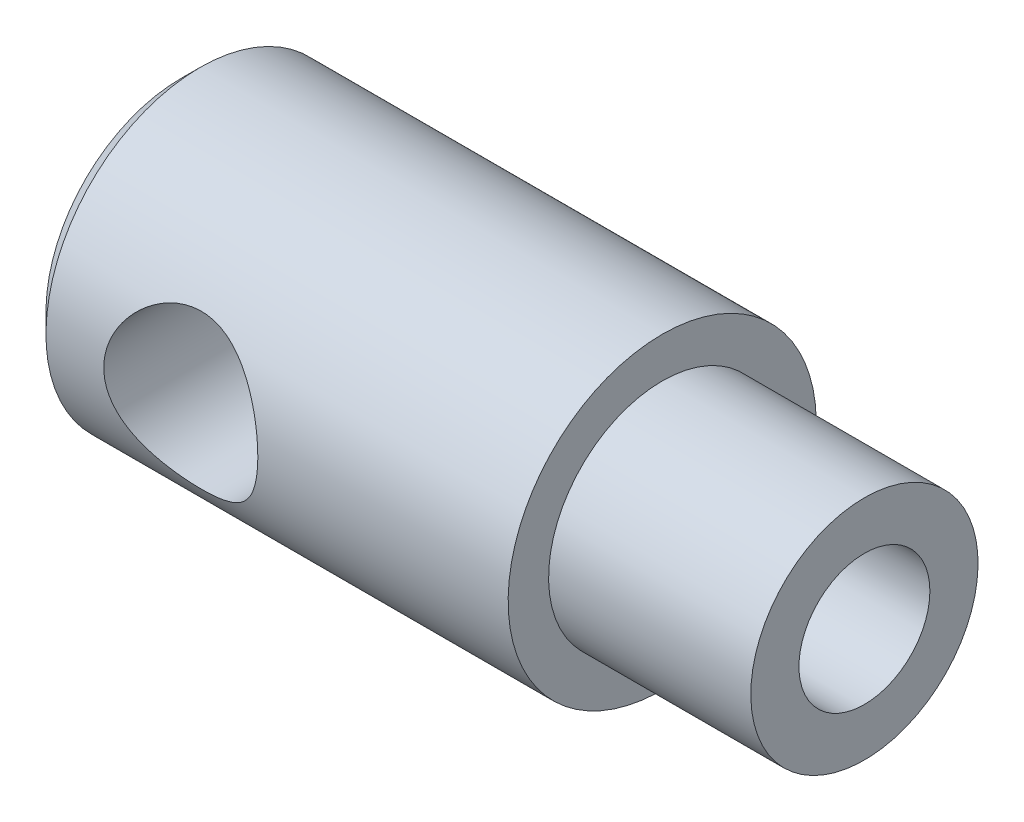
ISO-10303-21;
HEADER;
FILE_DESCRIPTION(('STEP AP214'),'2;1');
FILE_NAME('part.step','',(''),(''),'','','');
FILE_SCHEMA(('AUTOMOTIVE_DESIGN { 1 0 10303 214 1 1 1 1 }'));
ENDSEC;
DATA;
#1=APPLICATION_CONTEXT('core data for automotive mechanical design processes');
#2=APPLICATION_PROTOCOL_DEFINITION('international standard','automotive_design',2000,#1);
#3=PRODUCT_CONTEXT('',#1,'mechanical');
#4=PRODUCT('Part','Part','',(#3));
#5=PRODUCT_RELATED_PRODUCT_CATEGORY('part','',(#4));
#6=PRODUCT_DEFINITION_FORMATION('','',#4);
#7=PRODUCT_DEFINITION_CONTEXT('part definition',#1,'design');
#8=PRODUCT_DEFINITION('design','',#6,#7);
#9=PRODUCT_DEFINITION_SHAPE('','',#8);
#10=(LENGTH_UNIT() NAMED_UNIT(*) SI_UNIT(.MILLI.,.METRE.));
#11=(NAMED_UNIT(*) PLANE_ANGLE_UNIT() SI_UNIT($,.RADIAN.));
#12=(NAMED_UNIT(*) SI_UNIT($,.STERADIAN.) SOLID_ANGLE_UNIT());
#13=UNCERTAINTY_MEASURE_WITH_UNIT(LENGTH_MEASURE(1.E-05),#10,'distance_accuracy_value','');
#14=(GEOMETRIC_REPRESENTATION_CONTEXT(3) GLOBAL_UNCERTAINTY_ASSIGNED_CONTEXT((#13)) GLOBAL_UNIT_ASSIGNED_CONTEXT((#10,
#11,#12)) REPRESENTATION_CONTEXT('',''));
#15=CARTESIAN_POINT('',(0.,0.,0.));
#16=DIRECTION('',(0.,0.,1.));
#17=DIRECTION('',(1.,0.,0.));
#18=AXIS2_PLACEMENT_3D('',#15,#16,#17);
#19=CARTESIAN_POINT('',(0.,0.,0.));
#20=DIRECTION('',(-1.,0.,0.));
#21=DIRECTION('',(0.,-1.,0.));
#22=AXIS2_PLACEMENT_3D('',#19,#20,#21);
#23=PLANE('',#22);
#24=CARTESIAN_POINT('',(0.,0.,0.));
#25=DIRECTION('',(1.,0.,0.));
#26=DIRECTION('',(0.,1.,0.));
#27=AXIS2_PLACEMENT_3D('',#24,#25,#26);
#28=CIRCLE('',#27,6.99999999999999);
#29=CARTESIAN_POINT('',(0.,6.99999999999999,0.));
#30=VERTEX_POINT('',#29);
#31=EDGE_CURVE('E10',#30,#30,#28,.T.);
#32=ORIENTED_EDGE('',*,*,#31,.F.);
#33=EDGE_LOOP('',(#32));
#34=FACE_BOUND('',#33,.T.);
#35=ADVANCED_FACE('F34',(#34),#23,.T.);
#36=CARTESIAN_POINT('',(1.,0.,0.));
#37=DIRECTION('',(1.,0.,0.));
#38=DIRECTION('',(0.,1.,0.));
#39=AXIS2_PLACEMENT_3D('',#36,#37,#38);
#40=CONICAL_SURFACE('',#39,7.99999999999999,0.785398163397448);
#41=ORIENTED_EDGE('',*,*,#31,.T.);
#42=EDGE_LOOP('',(#41));
#43=FACE_BOUND('',#42,.T.);
#44=CARTESIAN_POINT('',(1.,0.,0.));
#45=DIRECTION('',(1.,0.,0.));
#46=DIRECTION('',(0.,1.,0.));
#47=AXIS2_PLACEMENT_3D('',#44,#45,#46);
#48=CIRCLE('',#47,7.99999999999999);
#49=CARTESIAN_POINT('',(1.,7.99999999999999,0.));
#50=VERTEX_POINT('',#49);
#51=EDGE_CURVE('E45',#50,#50,#48,.T.);
#52=ORIENTED_EDGE('',*,*,#51,.F.);
#53=EDGE_LOOP('',(#52));
#54=FACE_BOUND('',#53,.T.);
#55=ADVANCED_FACE('F87',(#43,#54),#40,.T.);
#56=CARTESIAN_POINT('',(35.5,0.,0.));
#57=DIRECTION('',(1.,0.,0.));
#58=DIRECTION('',(0.,1.,0.));
#59=AXIS2_PLACEMENT_3D('',#56,#57,#58);
#60=CYLINDRICAL_SURFACE('',#59,7.99999999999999);
#61=CARTESIAN_POINT('',(12.,0.,-7.99999999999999));
#62=CARTESIAN_POINT('',(11.9999995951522,-0.105191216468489,-7.99999964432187));
#63=CARTESIAN_POINT('',(11.9958455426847,-0.210389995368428,-7.99792027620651));
#64=CARTESIAN_POINT('',(11.9792779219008,-0.420011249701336,-7.98965597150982));
#65=CARTESIAN_POINT('',(11.9668607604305,-0.524433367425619,-7.98346924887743));
#66=CARTESIAN_POINT('',(11.9338864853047,-0.731828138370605,-7.96713597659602));
#67=CARTESIAN_POINT('',(11.9133177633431,-0.834798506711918,-7.95698378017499));
#68=CARTESIAN_POINT('',(11.8642827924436,-1.0384152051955,-7.93298382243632));
#69=CARTESIAN_POINT('',(11.8358133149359,-1.1390605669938,-7.91913455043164));
#70=CARTESIAN_POINT('',(11.7392517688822,-1.43561775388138,-7.87265974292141));
#71=CARTESIAN_POINT('',(11.6598370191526,-1.6271962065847,-7.83501976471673));
#72=CARTESIAN_POINT('',(11.4737109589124,-1.99392146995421,-7.74982886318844));
#73=CARTESIAN_POINT('',(11.3670018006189,-2.16906957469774,-7.70227872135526));
#74=CARTESIAN_POINT('',(11.1219301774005,-2.51002321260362,-7.59825056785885));
#75=CARTESIAN_POINT('',(10.9820433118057,-2.67462250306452,-7.54140647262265));
#76=CARTESIAN_POINT('',(10.6779248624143,-2.97911611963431,-7.42640030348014));
#77=CARTESIAN_POINT('',(10.5136749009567,-3.11899161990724,-7.36823726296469));
#78=CARTESIAN_POINT('',(10.1500210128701,-3.38102385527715,-7.25195135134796));
#79=CARTESIAN_POINT('',(9.94887869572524,-3.50096528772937,-7.19418138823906));
#80=CARTESIAN_POINT('',(9.63206546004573,-3.65378721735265,-7.11709930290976));
#81=CARTESIAN_POINT('',(9.5239053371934,-3.70022392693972,-7.09299422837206));
#82=CARTESIAN_POINT('',(9.30319902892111,-3.78359067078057,-7.04887690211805));
#83=CARTESIAN_POINT('',(9.1906554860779,-3.82052633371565,-7.02886222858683));
#84=CARTESIAN_POINT('',(8.96880578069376,-3.88251046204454,-6.99480449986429));
#85=CARTESIAN_POINT('',(8.85970358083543,-3.9081340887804,-6.98047764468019));
#86=CARTESIAN_POINT('',(8.63925947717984,-3.95018060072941,-6.95677065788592));
#87=CARTESIAN_POINT('',(8.52791879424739,-3.96660836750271,-6.94738790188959));
#88=CARTESIAN_POINT('',(8.30399390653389,-3.99001913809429,-6.93396933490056));
#89=CARTESIAN_POINT('',(8.19141049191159,-3.99700782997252,-6.92993030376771));
#90=CARTESIAN_POINT('',(7.96599952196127,-4.00144340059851,-6.92737022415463));
#91=CARTESIAN_POINT('',(7.853171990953,-3.99889118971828,-6.92884864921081));
#92=CARTESIAN_POINT('',(7.64183562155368,-3.98516575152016,-6.93675038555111));
#93=CARTESIAN_POINT('',(7.54323256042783,-3.97506329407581,-6.94255931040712));
#94=CARTESIAN_POINT('',(7.34734838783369,-3.94763759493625,-6.9581892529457));
#95=CARTESIAN_POINT('',(7.25006770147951,-3.93031208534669,-6.96801153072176));
#96=CARTESIAN_POINT('',(6.96122086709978,-3.86777248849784,-7.00304835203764));
#97=CARTESIAN_POINT('',(6.77250454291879,-3.81198555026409,-7.03383903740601));
#98=CARTESIAN_POINT('',(6.40305366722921,-3.6728359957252,-7.10749917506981));
#99=CARTESIAN_POINT('',(6.22260742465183,-3.58886132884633,-7.15063327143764));
#100=CARTESIAN_POINT('',(5.87746981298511,-3.39616568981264,-7.24413652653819));
#101=CARTESIAN_POINT('',(5.71278556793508,-3.28743360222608,-7.29450893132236));
#102=CARTESIAN_POINT('',(5.38191711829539,-3.03227252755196,-7.40452458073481));
#103=CARTESIAN_POINT('',(5.2181904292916,-2.88281182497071,-7.46453347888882));
#104=CARTESIAN_POINT('',(4.91704039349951,-2.55818830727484,-7.58191186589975));
#105=CARTESIAN_POINT('',(4.77962961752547,-2.38301327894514,-7.63928008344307));
#106=CARTESIAN_POINT('',(4.59324696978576,-2.09944472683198,-7.72027607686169));
#107=CARTESIAN_POINT('',(4.53331824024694,-1.9989679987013,-7.74696304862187));
#108=CARTESIAN_POINT('',(4.42223352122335,-1.79256850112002,-7.79730441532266));
#109=CARTESIAN_POINT('',(4.37107383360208,-1.68664805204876,-7.82096008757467));
#110=CARTESIAN_POINT('',(4.2780808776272,-1.47010242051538,-7.86454042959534));
#111=CARTESIAN_POINT('',(4.23624385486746,-1.35947915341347,-7.88446660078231));
#112=CARTESIAN_POINT('',(4.1623800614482,-1.13432950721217,-7.91999221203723));
#113=CARTESIAN_POINT('',(4.13035216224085,-1.01980357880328,-7.93559214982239));
#114=CARTESIAN_POINT('',(4.07877315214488,-0.797438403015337,-7.96087677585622));
#115=CARTESIAN_POINT('',(4.05840840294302,-0.689830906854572,-7.97094436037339));
#116=CARTESIAN_POINT('',(4.0265535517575,-0.472998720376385,-7.98674429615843));
#117=CARTESIAN_POINT('',(4.01506266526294,-0.363774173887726,-7.99247703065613));
#118=CARTESIAN_POINT('',(4.00110952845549,-0.144648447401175,-7.99944300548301));
#119=CARTESIAN_POINT('',(3.99864382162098,-0.0347475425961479,-8.00067796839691));
#120=CARTESIAN_POINT('',(4.00276424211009,0.184837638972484,-7.99861804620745));
#121=CARTESIAN_POINT('',(4.00934996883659,0.294521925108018,-7.99532336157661));
#122=CARTESIAN_POINT('',(4.03062356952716,0.504259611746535,-7.98472734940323));
#123=CARTESIAN_POINT('',(4.04464106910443,0.60439825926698,-7.97775776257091));
#124=CARTESIAN_POINT('',(4.08013639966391,0.803035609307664,-7.96021983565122));
#125=CARTESIAN_POINT('',(4.10161676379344,0.901533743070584,-7.94965027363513));
#126=CARTESIAN_POINT('',(4.17693517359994,1.19351737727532,-7.91289127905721));
#127=CARTESIAN_POINT('',(4.24167014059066,1.38368108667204,-7.88164133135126));
#128=CARTESIAN_POINT('',(4.39999810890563,1.75558493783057,-7.80736894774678));
#129=CARTESIAN_POINT('',(4.49436330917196,1.93692876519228,-7.76403545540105));
#130=CARTESIAN_POINT('',(4.70843103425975,2.28183826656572,-7.6697587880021));
#131=CARTESIAN_POINT('',(4.82814435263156,2.44539632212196,-7.61881237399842));
#132=CARTESIAN_POINT('',(5.10303311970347,2.76706877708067,-7.50833088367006));
#133=CARTESIAN_POINT('',(5.26053653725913,2.92307134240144,-7.44844369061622));
#134=CARTESIAN_POINT('',(5.5997355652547,3.20744226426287,-7.33048735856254));
#135=CARTESIAN_POINT('',(5.7814477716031,3.33579150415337,-7.27241950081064));
#136=CARTESIAN_POINT('',(6.07399401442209,3.50772930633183,-7.1902816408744));
#137=CARTESIAN_POINT('',(6.17748375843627,3.5626157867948,-7.16316684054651));
#138=CARTESIAN_POINT('',(6.3895184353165,3.66334616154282,-7.11217812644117));
#139=CARTESIAN_POINT('',(6.49806090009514,3.70919441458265,-7.08830265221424));
#140=CARTESIAN_POINT('',(6.71942164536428,3.79131200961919,-7.04472262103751));
#141=CARTESIAN_POINT('',(6.83223640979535,3.82758904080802,-7.02501471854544));
#142=CARTESIAN_POINT('',(7.06135278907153,3.89012004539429,-6.99058253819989));
#143=CARTESIAN_POINT('',(7.17765386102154,3.91637557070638,-6.9758574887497));
#144=CARTESIAN_POINT('',(7.40141213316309,3.95643062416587,-6.9532102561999));
#145=CARTESIAN_POINT('',(7.50864683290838,3.97118378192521,-6.94477079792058));
#146=CARTESIAN_POINT('',(7.72422767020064,3.99195118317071,-6.93285441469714));
#147=CARTESIAN_POINT('',(7.8325736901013,3.99796634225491,-6.92937696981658));
#148=CARTESIAN_POINT('',(8.04940749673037,4.00116308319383,-6.92753208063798));
#149=CARTESIAN_POINT('',(8.15789522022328,3.99834777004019,-6.92916284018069));
#150=CARTESIAN_POINT('',(8.37406114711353,3.98394653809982,-6.93745093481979));
#151=CARTESIAN_POINT('',(8.48173938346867,3.97236097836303,-6.94410806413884));
#152=CARTESIAN_POINT('',(8.78180013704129,3.92770249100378,-6.9695287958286));
#153=CARTESIAN_POINT('',(8.97236586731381,3.88483285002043,-6.99372760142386));
#154=CARTESIAN_POINT('',(9.34326850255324,3.77270184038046,-7.05483682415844));
#155=CARTESIAN_POINT('',(9.5236020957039,3.70343198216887,-7.09175132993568));
#156=CARTESIAN_POINT('',(9.88248855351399,3.53526338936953,-7.17714225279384));
#157=CARTESIAN_POINT('',(10.0601077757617,3.43468670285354,-7.22622883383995));
#158=CARTESIAN_POINT('',(10.397101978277,3.20860173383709,-7.32941332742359));
#159=CARTESIAN_POINT('',(10.5564673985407,3.08308048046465,-7.38351383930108));
#160=CARTESIAN_POINT('',(10.8725629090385,2.7928225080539,-7.49849148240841));
#161=CARTESIAN_POINT('',(11.0266199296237,2.625174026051,-7.55939328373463));
#162=CARTESIAN_POINT('',(11.3050684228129,2.26458287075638,-7.67511613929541));
#163=CARTESIAN_POINT('',(11.4294439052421,2.0716266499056,-7.72993390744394));
#164=CARTESIAN_POINT('',(11.5909042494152,1.76603106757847,-7.80335210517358));
#165=CARTESIAN_POINT('',(11.640693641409,1.66100410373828,-7.82643367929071));
#166=CARTESIAN_POINT('',(11.7311489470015,1.44639623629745,-7.86891796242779));
#167=CARTESIAN_POINT('',(11.771819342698,1.33681760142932,-7.8883224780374));
#168=CARTESIAN_POINT('',(11.843476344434,1.11415600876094,-7.92283587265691));
#169=CARTESIAN_POINT('',(11.8744840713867,1.00108129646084,-7.93795411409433));
#170=CARTESIAN_POINT('',(11.9265100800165,0.772189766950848,-7.96347694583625));
#171=CARTESIAN_POINT('',(11.9475344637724,0.656374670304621,-7.97388441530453));
#172=CARTESIAN_POINT('',(11.9755796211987,0.45043331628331,-7.98781110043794));
#173=CARTESIAN_POINT('',(11.984729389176,0.360660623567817,-7.99237392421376));
#174=CARTESIAN_POINT('',(11.9969398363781,0.18059382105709,-7.99846856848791));
#175=CARTESIAN_POINT('',(12.000000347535,0.0902996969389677,-8.00000030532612));
#176=CARTESIAN_POINT('',(12.,0.,-7.99999999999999));
#177=B_SPLINE_CURVE_WITH_KNOTS('',3,(#61,#62,#63,#64,#65,#66,#67,#68,#69,#70,#71,#72,#73,#74,
#75,#76,#77,#78,#79,#80,#81,#82,#83,#84,#85,#86,#87,#88,#89,#90,#91,#92,#93,#94,#95,#96,#97,#98,
#99,#100,#101,#102,#103,#104,#105,#106,#107,#108,#109,#110,#111,#112,#113,#114,#115,#116,#117,
#118,#119,#120,#121,#122,#123,#124,#125,#126,#127,#128,#129,#130,#131,#132,#133,#134,#135,#136,
#137,#138,#139,#140,#141,#142,#143,#144,#145,#146,#147,#148,#149,#150,#151,#152,#153,#154,#155,
#156,#157,#158,#159,#160,#161,#162,#163,#164,#165,#166,#167,#168,#169,#170,#171,#172,#173,#174,
#175,#176),.UNSPECIFIED.,.T.,.F.,(4,2,2,2,2,2,2,2,2,2,2,2,2,2,2,2,2,2,2,2,2,2,2,2,2,2,2,2,2,2,2,
2,2,2,2,2,2,2,2,2,2,2,2,2,2,2,2,2,2,2,2,2,2,2,2,2,2,4),(0.,0.315484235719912,0.631105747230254,
0.947178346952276,1.26338029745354,1.89263632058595,2.52184274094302,3.18911473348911,
3.85689264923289,4.57645675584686,4.93648208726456,5.29629363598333,5.63476191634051,
5.97305035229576,6.31113484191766,6.64918707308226,6.94669148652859,7.24428938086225,
7.83905304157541,8.44767049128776,9.05656173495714,9.74265853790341,10.4290822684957,
10.7886699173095,11.1481055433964,11.5073961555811,11.8666454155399,12.1961419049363,
12.5256092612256,12.8549504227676,13.184277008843,13.4879760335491,13.791778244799,
14.3988188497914,15.0232162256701,15.6478800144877,16.33388641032,17.0203655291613,
17.380682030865,17.7408243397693,18.1006764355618,18.4604727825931,18.7857371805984,
19.1109674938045,19.4360834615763,19.7611861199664,20.3488209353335,20.9366448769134,
21.5639619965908,22.1916061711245,22.8955134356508,23.5997990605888,23.9548906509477,
24.3098073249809,24.6639426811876,25.0178613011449,25.2886761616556,25.5594984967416),.UNSPECIFIED.);
#178=CARTESIAN_POINT('',(12.,0.,-7.99999999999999));
#179=VERTEX_POINT('',#178);
#180=EDGE_CURVE('E59',#179,#179,#177,.T.);
#181=ORIENTED_EDGE('',*,*,#180,.F.);
#182=EDGE_LOOP('',(#181));
#183=FACE_BOUND('',#182,.T.);
#184=CARTESIAN_POINT('',(12.,0.,7.99999999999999));
#185=CARTESIAN_POINT('',(11.9999995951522,0.105191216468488,7.99999964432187));
#186=CARTESIAN_POINT('',(11.9958455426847,0.210389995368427,7.99792027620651));
#187=CARTESIAN_POINT('',(11.9792779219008,0.420011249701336,7.98965597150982));
#188=CARTESIAN_POINT('',(11.9668607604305,0.524433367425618,7.98346924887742));
#189=CARTESIAN_POINT('',(11.9338864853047,0.731828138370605,7.96713597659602));
#190=CARTESIAN_POINT('',(11.9133177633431,0.834798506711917,7.95698378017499));
#191=CARTESIAN_POINT('',(11.8642827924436,1.0384152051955,7.93298382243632));
#192=CARTESIAN_POINT('',(11.8358133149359,1.1390605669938,7.91913455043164));
#193=CARTESIAN_POINT('',(11.7392517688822,1.43561775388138,7.87265974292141));
#194=CARTESIAN_POINT('',(11.6598370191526,1.6271962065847,7.83501976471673));
#195=CARTESIAN_POINT('',(11.4737109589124,1.99392146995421,7.74982886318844));
#196=CARTESIAN_POINT('',(11.3670018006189,2.16906957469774,7.70227872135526));
#197=CARTESIAN_POINT('',(11.1219301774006,2.51002321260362,7.59825056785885));
#198=CARTESIAN_POINT('',(10.9820433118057,2.67462250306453,7.54140647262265));
#199=CARTESIAN_POINT('',(10.6779248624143,2.97911611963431,7.42640030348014));
#200=CARTESIAN_POINT('',(10.5136749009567,3.11899161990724,7.36823726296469));
#201=CARTESIAN_POINT('',(10.1500210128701,3.38102385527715,7.25195135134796));
#202=CARTESIAN_POINT('',(9.94887869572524,3.50096528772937,7.19418138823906));
#203=CARTESIAN_POINT('',(9.63206546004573,3.65378721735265,7.11709930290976));
#204=CARTESIAN_POINT('',(9.5239053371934,3.70022392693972,7.09299422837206));
#205=CARTESIAN_POINT('',(9.30319902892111,3.78359067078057,7.04887690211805));
#206=CARTESIAN_POINT('',(9.1906554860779,3.82052633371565,7.02886222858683));
#207=CARTESIAN_POINT('',(8.96880578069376,3.88251046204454,6.99480449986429));
#208=CARTESIAN_POINT('',(8.85970358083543,3.9081340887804,6.98047764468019));
#209=CARTESIAN_POINT('',(8.63925947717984,3.95018060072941,6.95677065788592));
#210=CARTESIAN_POINT('',(8.52791879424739,3.96660836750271,6.94738790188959));
#211=CARTESIAN_POINT('',(8.30399390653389,3.99001913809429,6.93396933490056));
#212=CARTESIAN_POINT('',(8.19141049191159,3.99700782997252,6.92993030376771));
#213=CARTESIAN_POINT('',(7.96599952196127,4.00144340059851,6.92737022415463));
#214=CARTESIAN_POINT('',(7.853171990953,3.99889118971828,6.92884864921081));
#215=CARTESIAN_POINT('',(7.64183562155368,3.98516575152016,6.93675038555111));
#216=CARTESIAN_POINT('',(7.54323256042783,3.97506329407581,6.94255931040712));
#217=CARTESIAN_POINT('',(7.34734838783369,3.94763759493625,6.95818925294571));
#218=CARTESIAN_POINT('',(7.25006770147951,3.93031208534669,6.96801153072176));
#219=CARTESIAN_POINT('',(6.96122086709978,3.86777248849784,7.00304835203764));
#220=CARTESIAN_POINT('',(6.77250454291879,3.81198555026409,7.03383903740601));
#221=CARTESIAN_POINT('',(6.40305366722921,3.6728359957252,7.10749917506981));
#222=CARTESIAN_POINT('',(6.22260742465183,3.58886132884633,7.15063327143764));
#223=CARTESIAN_POINT('',(5.87746981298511,3.39616568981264,7.24413652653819));
#224=CARTESIAN_POINT('',(5.71278556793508,3.28743360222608,7.29450893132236));
#225=CARTESIAN_POINT('',(5.38191711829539,3.03227252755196,7.40452458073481));
#226=CARTESIAN_POINT('',(5.2181904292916,2.88281182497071,7.46453347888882));
#227=CARTESIAN_POINT('',(4.91704039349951,2.55818830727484,7.58191186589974));
#228=CARTESIAN_POINT('',(4.77962961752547,2.38301327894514,7.63928008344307));
#229=CARTESIAN_POINT('',(4.59324696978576,2.09944472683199,7.72027607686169));
#230=CARTESIAN_POINT('',(4.53331824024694,1.9989679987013,7.74696304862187));
#231=CARTESIAN_POINT('',(4.42223352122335,1.79256850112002,7.79730441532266));
#232=CARTESIAN_POINT('',(4.37107383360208,1.68664805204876,7.82096008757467));
#233=CARTESIAN_POINT('',(4.2780808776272,1.47010242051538,7.86454042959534));
#234=CARTESIAN_POINT('',(4.23624385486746,1.35947915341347,7.88446660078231));
#235=CARTESIAN_POINT('',(4.1623800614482,1.13432950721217,7.91999221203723));
#236=CARTESIAN_POINT('',(4.13035216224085,1.01980357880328,7.93559214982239));
#237=CARTESIAN_POINT('',(4.07877315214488,0.797438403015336,7.96087677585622));
#238=CARTESIAN_POINT('',(4.05840840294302,0.68983090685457,7.97094436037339));
#239=CARTESIAN_POINT('',(4.0265535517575,0.472998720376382,7.98674429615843));
#240=CARTESIAN_POINT('',(4.01506266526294,0.363774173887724,7.99247703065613));
#241=CARTESIAN_POINT('',(4.00110952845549,0.144648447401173,7.99944300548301));
#242=CARTESIAN_POINT('',(3.99864382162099,0.0347475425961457,8.00067796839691));
#243=CARTESIAN_POINT('',(4.00276424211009,-0.184837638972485,7.99861804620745));
#244=CARTESIAN_POINT('',(4.00934996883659,-0.294521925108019,7.99532336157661));
#245=CARTESIAN_POINT('',(4.03062356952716,-0.504259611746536,7.98472734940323));
#246=CARTESIAN_POINT('',(4.04464106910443,-0.604398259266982,7.97775776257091));
#247=CARTESIAN_POINT('',(4.08013639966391,-0.803035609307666,7.96021983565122));
#248=CARTESIAN_POINT('',(4.10161676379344,-0.901533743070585,7.94965027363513));
#249=CARTESIAN_POINT('',(4.17693517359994,-1.19351737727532,7.91289127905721));
#250=CARTESIAN_POINT('',(4.24167014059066,-1.38368108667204,7.88164133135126));
#251=CARTESIAN_POINT('',(4.39999810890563,-1.75558493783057,7.80736894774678));
#252=CARTESIAN_POINT('',(4.49436330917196,-1.93692876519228,7.76403545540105));
#253=CARTESIAN_POINT('',(4.70843103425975,-2.28183826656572,7.6697587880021));
#254=CARTESIAN_POINT('',(4.82814435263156,-2.44539632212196,7.61881237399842));
#255=CARTESIAN_POINT('',(5.10303311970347,-2.76706877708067,7.50833088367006));
#256=CARTESIAN_POINT('',(5.26053653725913,-2.92307134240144,7.44844369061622));
#257=CARTESIAN_POINT('',(5.5997355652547,-3.20744226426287,7.33048735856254));
#258=CARTESIAN_POINT('',(5.7814477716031,-3.33579150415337,7.27241950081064));
#259=CARTESIAN_POINT('',(6.07399401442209,-3.50772930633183,7.1902816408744));
#260=CARTESIAN_POINT('',(6.17748375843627,-3.5626157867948,7.16316684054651));
#261=CARTESIAN_POINT('',(6.3895184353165,-3.66334616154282,7.11217812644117));
#262=CARTESIAN_POINT('',(6.49806090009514,-3.70919441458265,7.08830265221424));
#263=CARTESIAN_POINT('',(6.71942164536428,-3.79131200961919,7.04472262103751));
#264=CARTESIAN_POINT('',(6.83223640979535,-3.82758904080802,7.02501471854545));
#265=CARTESIAN_POINT('',(7.06135278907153,-3.89012004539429,6.99058253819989));
#266=CARTESIAN_POINT('',(7.17765386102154,-3.91637557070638,6.9758574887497));
#267=CARTESIAN_POINT('',(7.40141213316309,-3.95643062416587,6.9532102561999));
#268=CARTESIAN_POINT('',(7.50864683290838,-3.97118378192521,6.94477079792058));
#269=CARTESIAN_POINT('',(7.72422767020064,-3.99195118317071,6.93285441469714));
#270=CARTESIAN_POINT('',(7.8325736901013,-3.99796634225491,6.92937696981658));
#271=CARTESIAN_POINT('',(8.04940749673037,-4.00116308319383,6.92753208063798));
#272=CARTESIAN_POINT('',(8.15789522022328,-3.99834777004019,6.92916284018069));
#273=CARTESIAN_POINT('',(8.37406114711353,-3.98394653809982,6.9374509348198));
#274=CARTESIAN_POINT('',(8.48173938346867,-3.97236097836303,6.94410806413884));
#275=CARTESIAN_POINT('',(8.78180013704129,-3.92770249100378,6.96952879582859));
#276=CARTESIAN_POINT('',(8.97236586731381,-3.88483285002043,6.99372760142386));
#277=CARTESIAN_POINT('',(9.34326850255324,-3.77270184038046,7.05483682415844));
#278=CARTESIAN_POINT('',(9.5236020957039,-3.70343198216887,7.09175132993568));
#279=CARTESIAN_POINT('',(9.882488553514,-3.53526338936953,7.17714225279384));
#280=CARTESIAN_POINT('',(10.0601077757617,-3.43468670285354,7.22622883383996));
#281=CARTESIAN_POINT('',(10.397101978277,-3.20860173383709,7.32941332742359));
#282=CARTESIAN_POINT('',(10.5564673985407,-3.08308048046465,7.38351383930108));
#283=CARTESIAN_POINT('',(10.8725629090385,-2.7928225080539,7.49849148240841));
#284=CARTESIAN_POINT('',(11.0266199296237,-2.625174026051,7.55939328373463));
#285=CARTESIAN_POINT('',(11.3050684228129,-2.26458287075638,7.67511613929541));
#286=CARTESIAN_POINT('',(11.4294439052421,-2.0716266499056,7.72993390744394));
#287=CARTESIAN_POINT('',(11.5909042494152,-1.76603106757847,7.80335210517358));
#288=CARTESIAN_POINT('',(11.640693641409,-1.66100410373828,7.82643367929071));
#289=CARTESIAN_POINT('',(11.7311489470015,-1.44639623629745,7.86891796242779));
#290=CARTESIAN_POINT('',(11.771819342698,-1.33681760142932,7.8883224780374));
#291=CARTESIAN_POINT('',(11.843476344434,-1.11415600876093,7.92283587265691));
#292=CARTESIAN_POINT('',(11.8744840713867,-1.00108129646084,7.93795411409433));
#293=CARTESIAN_POINT('',(11.9265100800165,-0.772189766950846,7.96347694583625));
#294=CARTESIAN_POINT('',(11.9475344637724,-0.656374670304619,7.97388441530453));
#295=CARTESIAN_POINT('',(11.9755796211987,-0.450433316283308,7.98781110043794));
#296=CARTESIAN_POINT('',(11.984729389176,-0.360660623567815,7.99237392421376));
#297=CARTESIAN_POINT('',(11.9969398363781,-0.180593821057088,7.99846856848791));
#298=CARTESIAN_POINT('',(12.000000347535,-0.0902996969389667,8.00000030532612));
#299=CARTESIAN_POINT('',(12.,0.,7.99999999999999));
#300=B_SPLINE_CURVE_WITH_KNOTS('',3,(#184,#185,#186,#187,#188,#189,#190,#191,#192,#193,#194,
#195,#196,#197,#198,#199,#200,#201,#202,#203,#204,#205,#206,#207,#208,#209,#210,#211,#212,#213,
#214,#215,#216,#217,#218,#219,#220,#221,#222,#223,#224,#225,#226,#227,#228,#229,#230,#231,#232,
#233,#234,#235,#236,#237,#238,#239,#240,#241,#242,#243,#244,#245,#246,#247,#248,#249,#250,#251,
#252,#253,#254,#255,#256,#257,#258,#259,#260,#261,#262,#263,#264,#265,#266,#267,#268,#269,#270,
#271,#272,#273,#274,#275,#276,#277,#278,#279,#280,#281,#282,#283,#284,#285,#286,#287,#288,#289,
#290,#291,#292,#293,#294,#295,#296,#297,#298,#299),.UNSPECIFIED.,.T.,.F.,(4,2,2,2,2,2,2,2,2,2,2,
2,2,2,2,2,2,2,2,2,2,2,2,2,2,2,2,2,2,2,2,2,2,2,2,2,2,2,2,2,2,2,2,2,2,2,2,2,2,2,2,2,2,2,2,2,2,4),
(0.,0.315484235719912,0.631105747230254,0.947178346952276,1.26338029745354,1.89263632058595,
2.52184274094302,3.18911473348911,3.85689264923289,4.57645675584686,4.93648208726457,
5.29629363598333,5.63476191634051,5.97305035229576,6.31113484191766,6.64918707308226,
6.94669148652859,7.24428938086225,7.83905304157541,8.44767049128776,9.05656173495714,
9.74265853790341,10.4290822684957,10.7886699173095,11.1481055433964,11.5073961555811,
11.8666454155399,12.1961419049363,12.5256092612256,12.8549504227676,13.184277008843,
13.4879760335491,13.791778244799,14.3988188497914,15.0232162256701,15.6478800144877,
16.33388641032,17.0203655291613,17.380682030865,17.7408243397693,18.1006764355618,
18.4604727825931,18.7857371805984,19.1109674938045,19.4360834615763,19.7611861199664,
20.3488209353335,20.9366448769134,21.5639619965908,22.1916061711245,22.8955134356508,
23.5997990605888,23.9548906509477,24.3098073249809,24.6639426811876,25.0178613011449,
25.2886761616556,25.5594984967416),.UNSPECIFIED.);
#301=CARTESIAN_POINT('',(12.,0.,7.99999999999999));
#302=VERTEX_POINT('',#301);
#303=EDGE_CURVE('E54',#302,#302,#300,.T.);
#304=ORIENTED_EDGE('',*,*,#303,.F.);
#305=EDGE_LOOP('',(#304));
#306=FACE_BOUND('',#305,.T.);
#307=ORIENTED_EDGE('',*,*,#51,.T.);
#308=EDGE_LOOP('',(#307));
#309=FACE_BOUND('',#308,.T.);
#310=CARTESIAN_POINT('',(25.,0.,0.));
#311=DIRECTION('',(1.,0.,0.));
#312=DIRECTION('',(0.,1.,0.));
#313=AXIS2_PLACEMENT_3D('',#310,#311,#312);
#314=CIRCLE('',#313,7.99999999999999);
#315=CARTESIAN_POINT('',(25.,7.99999999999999,0.));
#316=VERTEX_POINT('',#315);
#317=EDGE_CURVE('E50',#316,#316,#314,.T.);
#318=ORIENTED_EDGE('',*,*,#317,.F.);
#319=EDGE_LOOP('',(#318));
#320=FACE_BOUND('',#319,.T.);
#321=ADVANCED_FACE('F62',(#183,#306,#309,#320),#60,.T.);
#322=CARTESIAN_POINT('',(25.,7.99999999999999,0.));
#323=DIRECTION('',(1.,0.,0.));
#324=DIRECTION('',(0.,1.,0.));
#325=AXIS2_PLACEMENT_3D('',#322,#323,#324);
#326=PLANE('',#325);
#327=ORIENTED_EDGE('',*,*,#317,.T.);
#328=EDGE_LOOP('',(#327));
#329=FACE_BOUND('',#328,.T.);
#330=CARTESIAN_POINT('',(25.,0.,0.));
#331=DIRECTION('',(1.,0.,0.));
#332=DIRECTION('',(0.,1.,0.));
#333=AXIS2_PLACEMENT_3D('',#330,#331,#332);
#334=CIRCLE('',#333,5.9);
#335=CARTESIAN_POINT('',(25.,5.9,0.));
#336=VERTEX_POINT('',#335);
#337=EDGE_CURVE('E103',#336,#336,#334,.T.);
#338=ORIENTED_EDGE('',*,*,#337,.F.);
#339=EDGE_LOOP('',(#338));
#340=FACE_BOUND('',#339,.T.);
#341=ADVANCED_FACE('F80',(#329,#340),#326,.T.);
#342=CARTESIAN_POINT('',(35.5,0.,0.));
#343=DIRECTION('',(1.,0.,0.));
#344=DIRECTION('',(0.,1.,0.));
#345=AXIS2_PLACEMENT_3D('',#342,#343,#344);
#346=CYLINDRICAL_SURFACE('',#345,5.9);
#347=ORIENTED_EDGE('',*,*,#337,.T.);
#348=EDGE_LOOP('',(#347));
#349=FACE_BOUND('',#348,.T.);
#350=CARTESIAN_POINT('',(35.5,0.,0.));
#351=DIRECTION('',(1.,0.,0.));
#352=DIRECTION('',(0.,1.,0.));
#353=AXIS2_PLACEMENT_3D('',#350,#351,#352);
#354=CIRCLE('',#353,5.9);
#355=CARTESIAN_POINT('',(35.5,5.9,0.));
#356=VERTEX_POINT('',#355);
#357=EDGE_CURVE('E105',#356,#356,#354,.T.);
#358=ORIENTED_EDGE('',*,*,#357,.F.);
#359=EDGE_LOOP('',(#358));
#360=FACE_BOUND('',#359,.T.);
#361=ADVANCED_FACE('F77',(#349,#360),#346,.T.);
#362=CARTESIAN_POINT('',(35.5,5.9,0.));
#363=DIRECTION('',(1.,0.,0.));
#364=DIRECTION('',(0.,1.,0.));
#365=AXIS2_PLACEMENT_3D('',#362,#363,#364);
#366=PLANE('',#365);
#367=CARTESIAN_POINT('',(35.5,0.,0.));
#368=DIRECTION('',(1.,0.,0.));
#369=DIRECTION('',(0.,0.,-1.));
#370=AXIS2_PLACEMENT_3D('',#367,#368,#369);
#371=CIRCLE('',#370,3.4);
#372=CARTESIAN_POINT('',(35.5,0.,-3.4));
#373=VERTEX_POINT('',#372);
#374=EDGE_CURVE('E110',#373,#373,#371,.T.);
#375=ORIENTED_EDGE('',*,*,#374,.F.);
#376=EDGE_LOOP('',(#375));
#377=FACE_BOUND('',#376,.T.);
#378=ORIENTED_EDGE('',*,*,#357,.T.);
#379=EDGE_LOOP('',(#378));
#380=FACE_BOUND('',#379,.T.);
#381=ADVANCED_FACE('F70',(#377,#380),#366,.T.);
#382=CARTESIAN_POINT('',(8.,0.,-10.));
#383=DIRECTION('',(0.,0.,1.));
#384=DIRECTION('',(1.,0.,0.));
#385=AXIS2_PLACEMENT_3D('',#382,#383,#384);
#386=CYLINDRICAL_SURFACE('',#385,4.);
#387=CARTESIAN_POINT('',(12.,0.,-3.4));
#388=CARTESIAN_POINT('',(12.0000022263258,0.0802683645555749,-3.4000023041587));
#389=CARTESIAN_POINT('',(11.9975801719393,0.160517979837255,-3.39715406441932));
#390=CARTESIAN_POINT('',(11.9879541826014,0.320357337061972,-3.38582160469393));
#391=CARTESIAN_POINT('',(11.9807489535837,0.399946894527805,-3.37733585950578));
#392=CARTESIAN_POINT('',(11.9617083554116,0.557848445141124,-3.3548724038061));
#393=CARTESIAN_POINT('',(11.9498692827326,0.636159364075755,-3.34089030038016));
#394=CARTESIAN_POINT('',(11.92182476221,0.790877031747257,-3.30768602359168));
#395=CARTESIAN_POINT('',(11.9056173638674,0.867282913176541,-3.28846150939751));
#396=CARTESIAN_POINT('',(11.8511564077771,1.09185166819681,-3.22365690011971));
#397=CARTESIAN_POINT('',(11.8069141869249,1.23654849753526,-3.17077097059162));
#398=CARTESIAN_POINT('',(11.7055316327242,1.51357111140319,-3.04829987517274));
#399=CARTESIAN_POINT('',(11.6483879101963,1.64589363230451,-2.97871032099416));
#400=CARTESIAN_POINT('',(11.5009380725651,1.94435154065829,-2.79651133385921));
#401=CARTESIAN_POINT('',(11.4062411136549,2.10449692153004,-2.67756421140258));
#402=CARTESIAN_POINT('',(11.2562898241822,2.32476931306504,-2.48296503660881));
#403=CARTESIAN_POINT('',(11.204886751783,2.39497960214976,-2.41526299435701));
#404=CARTESIAN_POINT('',(11.1004021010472,2.52877227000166,-2.27479750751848));
#405=CARTESIAN_POINT('',(11.047321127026,2.59235700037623,-2.20203587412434));
#406=CARTESIAN_POINT('',(10.9394539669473,2.7141038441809,-2.05019615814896));
#407=CARTESIAN_POINT('',(10.8846548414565,2.77213338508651,-1.97102141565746));
#408=CARTESIAN_POINT('',(10.7755954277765,2.88132280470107,-1.80765998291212));
#409=CARTESIAN_POINT('',(10.7213353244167,2.93248039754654,-1.72347163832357));
#410=CARTESIAN_POINT('',(10.6150043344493,3.0276772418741,-1.55013813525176));
#411=CARTESIAN_POINT('',(10.5629288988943,3.07173188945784,-1.46100427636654));
#412=CARTESIAN_POINT('',(10.4628671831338,3.15252499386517,-1.27735768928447));
#413=CARTESIAN_POINT('',(10.4148775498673,3.18926948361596,-1.18284947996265));
#414=CARTESIAN_POINT('',(10.3226468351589,3.25711522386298,-0.981445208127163));
#415=CARTESIAN_POINT('',(10.278873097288,3.28767263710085,-0.874143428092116));
#416=CARTESIAN_POINT('',(10.2035858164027,3.33860550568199,-0.653088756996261));
#417=CARTESIAN_POINT('',(10.1720453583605,3.35900334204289,-0.539350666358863));
#418=CARTESIAN_POINT('',(10.1259889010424,3.3883593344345,-0.305100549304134));
#419=CARTESIAN_POINT('',(10.1117197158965,3.39715180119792,-0.184515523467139));
#420=CARTESIAN_POINT('',(10.104454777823,3.40166225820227,0.0575217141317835));
#421=CARTESIAN_POINT('',(10.1114445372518,3.39738915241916,0.17897327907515));
#422=CARTESIAN_POINT('',(10.1424180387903,3.37791006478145,0.400339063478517));
#423=CARTESIAN_POINT('',(10.1637702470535,3.36439227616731,0.500807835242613));
#424=CARTESIAN_POINT('',(10.2175006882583,3.32922146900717,0.697330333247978));
#425=CARTESIAN_POINT('',(10.2498962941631,3.30755562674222,0.793376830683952));
#426=CARTESIAN_POINT('',(10.3194645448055,3.25909917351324,0.972722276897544));
#427=CARTESIAN_POINT('',(10.3560268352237,3.23287517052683,1.05642046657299));
#428=CARTESIAN_POINT('',(10.4336442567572,3.17485850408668,1.21974937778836));
#429=CARTESIAN_POINT('',(10.4747028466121,3.14306154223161,1.29937689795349));
#430=CARTESIAN_POINT('',(10.5597923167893,3.07416118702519,1.45491821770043));
#431=CARTESIAN_POINT('',(10.6038302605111,3.03704493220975,1.53082239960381));
#432=CARTESIAN_POINT('',(10.6935428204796,2.95777269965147,1.67887564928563));
#433=CARTESIAN_POINT('',(10.7392170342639,2.91561795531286,1.75102562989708));
#434=CARTESIAN_POINT('',(10.8840918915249,2.77505469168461,1.97261105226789));
#435=CARTESIAN_POINT('',(10.9845330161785,2.66763350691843,2.11565999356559));
#436=CARTESIAN_POINT('',(11.1809264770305,2.43012179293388,2.3846612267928));
#437=CARTESIAN_POINT('',(11.276884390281,2.30006043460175,2.51063515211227));
#438=CARTESIAN_POINT('',(11.4505960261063,2.02905151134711,2.73331709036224));
#439=CARTESIAN_POINT('',(11.5292034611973,1.88996295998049,2.83160110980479));
#440=CARTESIAN_POINT('',(11.6726624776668,1.59330090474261,3.00850788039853));
#441=CARTESIAN_POINT('',(11.7375275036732,1.43574570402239,3.08714986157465));
#442=CARTESIAN_POINT('',(11.8391693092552,1.13223225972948,3.20938698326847));
#443=CARTESIAN_POINT('',(11.8788266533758,0.988724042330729,3.25664012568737));
#444=CARTESIAN_POINT('',(11.9423283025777,0.693398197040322,3.3320217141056));
#445=CARTESIAN_POINT('',(11.9661835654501,0.541586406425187,3.36016341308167));
#446=CARTESIAN_POINT('',(11.9962135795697,0.233159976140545,3.39555774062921));
#447=CARTESIAN_POINT('',(12.0023181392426,0.0765287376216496,3.40272744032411));
#448=CARTESIAN_POINT('',(11.9960951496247,-0.235855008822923,3.39540576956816));
#449=CARTESIAN_POINT('',(11.9837673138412,-0.391607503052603,3.38091406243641));
#450=CARTESIAN_POINT('',(11.9430906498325,-0.687748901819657,3.33288354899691));
#451=CARTESIAN_POINT('',(11.9157878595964,-0.828490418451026,3.30058772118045));
#452=CARTESIAN_POINT('',(11.8478524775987,-1.1017657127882,3.219696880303));
#453=CARTESIAN_POINT('',(11.8072159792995,-1.23429707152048,3.17109709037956));
#454=CARTESIAN_POINT('',(11.6995120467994,-1.53176095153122,3.0410749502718));
#455=CARTESIAN_POINT('',(11.628150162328,-1.69271248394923,2.95411135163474));
#456=CARTESIAN_POINT('',(11.4715514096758,-1.994324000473,2.75953569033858));
#457=CARTESIAN_POINT('',(11.3862831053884,-2.13493661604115,2.65187674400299));
#458=CARTESIAN_POINT('',(11.241113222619,-2.34625742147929,2.46311845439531));
#459=CARTESIAN_POINT('',(11.1836768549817,-2.42341820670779,2.38718037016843));
#460=CARTESIAN_POINT('',(11.0669399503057,-2.56955581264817,2.22911797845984));
#461=CARTESIAN_POINT('',(11.0076396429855,-2.6385336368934,2.14699443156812));
#462=CARTESIAN_POINT('',(10.888610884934,-2.76833511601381,1.97681088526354));
#463=CARTESIAN_POINT('',(10.8288823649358,-2.8291574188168,1.88874990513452));
#464=CARTESIAN_POINT('',(10.71073634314,-2.94255156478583,1.70671604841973));
#465=CARTESIAN_POINT('',(10.6523181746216,-2.99512768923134,1.61274627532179));
#466=CARTESIAN_POINT('',(10.5265261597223,-3.10239836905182,1.39736131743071));
#467=CARTESIAN_POINT('',(10.4599767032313,-3.15505553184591,1.27442923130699));
#468=CARTESIAN_POINT('',(10.3376985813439,-3.24668735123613,1.01853572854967));
#469=CARTESIAN_POINT('',(10.2819457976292,-3.28569266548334,0.885597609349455));
#470=CARTESIAN_POINT('',(10.2014836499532,-3.33994248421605,0.644856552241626));
#471=CARTESIAN_POINT('',(10.1724808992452,-3.35871363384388,0.5393327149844));
#472=CARTESIAN_POINT('',(10.1293223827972,-3.38624658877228,0.324097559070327));
#473=CARTESIAN_POINT('',(10.1151323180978,-3.39503152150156,0.21439652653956));
#474=CARTESIAN_POINT('',(10.1042348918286,-3.40180160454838,-0.00688842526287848));
#475=CARTESIAN_POINT('',(10.1076269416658,-3.39972534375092,-0.11847948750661));
#476=CARTESIAN_POINT('',(10.1314097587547,-3.38485775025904,-0.339158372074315));
#477=CARTESIAN_POINT('',(10.1518295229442,-3.37204813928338,-0.448241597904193));
#478=CARTESIAN_POINT('',(10.2149782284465,-3.33101692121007,-0.696399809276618));
#479=CARTESIAN_POINT('',(10.2628435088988,-3.29910587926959,-0.833502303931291));
#480=CARTESIAN_POINT('',(10.3728238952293,-3.22090850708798,-1.0976665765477));
#481=CARTESIAN_POINT('',(10.4349912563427,-3.17456923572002,-1.2246891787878));
#482=CARTESIAN_POINT('',(10.5537637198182,-3.07943589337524,-1.44516374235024));
#483=CARTESIAN_POINT('',(10.6090754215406,-3.03289806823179,-1.54031982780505));
#484=CARTESIAN_POINT('',(10.7221073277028,-2.93187271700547,-1.7248768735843));
#485=CARTESIAN_POINT('',(10.7798288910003,-2.87738066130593,-1.81427451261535));
#486=CARTESIAN_POINT('',(10.8958243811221,-2.76061188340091,-1.98744089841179));
#487=CARTESIAN_POINT('',(10.9540982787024,-2.6983355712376,-2.07120994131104));
#488=CARTESIAN_POINT('',(11.0697090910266,-2.56604898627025,-2.23300371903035));
#489=CARTESIAN_POINT('',(11.1270463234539,-2.49604140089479,-2.31103043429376));
#490=CARTESIAN_POINT('',(11.2796296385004,-2.29549994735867,-2.514608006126));
#491=CARTESIAN_POINT('',(11.3727888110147,-2.15737136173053,-2.63442452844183));
#492=CARTESIAN_POINT('',(11.5462489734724,-1.85846185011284,-2.85311445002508));
#493=CARTESIAN_POINT('',(11.6265723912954,-1.69772137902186,-2.95202447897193));
#494=CARTESIAN_POINT('',(11.7533512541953,-1.39067320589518,-3.10630721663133));
#495=CARTESIAN_POINT('',(11.8033754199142,-1.24825143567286,-3.16645324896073));
#496=CARTESIAN_POINT('',(11.8879674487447,-0.952486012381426,-3.26757776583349));
#497=CARTESIAN_POINT('',(11.9225623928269,-0.799162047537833,-3.30858983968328));
#498=CARTESIAN_POINT('',(11.9651587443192,-0.537462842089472,-3.35895700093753));
#499=CARTESIAN_POINT('',(11.9781723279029,-0.431007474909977,-3.37429719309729));
#500=CARTESIAN_POINT('',(11.9955921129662,-0.216356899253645,-3.39481791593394));
#501=CARTESIAN_POINT('',(11.9999970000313,-0.108161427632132,-3.3999968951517));
#502=CARTESIAN_POINT('',(12.,0.,-3.4));
#503=B_SPLINE_CURVE_WITH_KNOTS('',3,(#387,#388,#389,#390,#391,#392,#393,#394,#395,#396,#397,
#398,#399,#400,#401,#402,#403,#404,#405,#406,#407,#408,#409,#410,#411,#412,#413,#414,#415,#416,
#417,#418,#419,#420,#421,#422,#423,#424,#425,#426,#427,#428,#429,#430,#431,#432,#433,#434,#435,
#436,#437,#438,#439,#440,#441,#442,#443,#444,#445,#446,#447,#448,#449,#450,#451,#452,#453,#454,
#455,#456,#457,#458,#459,#460,#461,#462,#463,#464,#465,#466,#467,#468,#469,#470,#471,#472,#473,
#474,#475,#476,#477,#478,#479,#480,#481,#482,#483,#484,#485,#486,#487,#488,#489,#490,#491,#492,
#493,#494,#495,#496,#497,#498,#499,#500,#501,#502),.UNSPECIFIED.,.T.,.F.,(4,2,2,2,2,2,2,2,2,2,2,
2,2,2,2,2,2,2,2,2,2,2,2,2,2,2,2,2,2,2,2,2,2,2,2,2,2,2,2,2,2,2,2,2,2,2,2,2,2,2,2,2,2,2,2,2,2,4),
(0.,0.240686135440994,0.48143741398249,0.722381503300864,0.963433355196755,1.44196958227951,
1.92063166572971,2.57924457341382,2.90976671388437,3.24017113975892,3.57712909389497,
3.91419885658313,4.25052787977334,4.58657817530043,4.94516909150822,5.30296651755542,
5.66581884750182,6.02842395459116,6.338061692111,6.64818880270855,6.9328606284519,
7.2177529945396,7.50334619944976,7.78886963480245,8.4022497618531,9.01484534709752,
9.5754819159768,10.1355674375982,10.6022189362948,11.068546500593,11.5367155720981,
12.0048919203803,12.4438986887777,12.8830341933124,13.4689840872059,14.0562773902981,
14.4235355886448,14.790748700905,15.1580226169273,15.5251052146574,15.9722221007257,
16.4183283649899,16.7502161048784,17.0813336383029,17.4143253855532,17.7478853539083,
18.1914454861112,18.6366527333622,18.9947087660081,19.352969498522,19.7112113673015,
20.0693290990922,20.6825186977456,21.2946248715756,21.7801902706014,22.2649000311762,
22.5891745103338,22.9134984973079),.UNSPECIFIED.);
#504=CARTESIAN_POINT('',(12.,0.,-3.4));
#505=VERTEX_POINT('',#504);
#506=EDGE_CURVE('E37',#505,#505,#503,.T.);
#507=ORIENTED_EDGE('',*,*,#506,.T.);
#508=EDGE_LOOP('',(#507));
#509=FACE_BOUND('',#508,.T.);
#510=ORIENTED_EDGE('',*,*,#180,.T.);
#511=EDGE_LOOP('',(#510));
#512=FACE_BOUND('',#511,.T.);
#513=ORIENTED_EDGE('',*,*,#303,.T.);
#514=EDGE_LOOP('',(#513));
#515=FACE_BOUND('',#514,.T.);
#516=ADVANCED_FACE('F65',(#509,#512,#515),#386,.F.);
#517=CARTESIAN_POINT('',(35.5,0.,0.));
#518=DIRECTION('',(1.,0.,0.));
#519=DIRECTION('',(0.,0.,-1.));
#520=AXIS2_PLACEMENT_3D('',#517,#518,#519);
#521=CYLINDRICAL_SURFACE('',#520,3.4);
#522=ORIENTED_EDGE('',*,*,#374,.T.);
#523=EDGE_LOOP('',(#522));
#524=FACE_BOUND('',#523,.T.);
#525=ORIENTED_EDGE('',*,*,#506,.F.);
#526=EDGE_LOOP('',(#525));
#527=FACE_BOUND('',#526,.T.);
#528=ADVANCED_FACE('F69',(#524,#527),#521,.F.);
#529=CLOSED_SHELL('',(#35,#55,#321,#341,#361,#381,#516,#528));
#530=MANIFOLD_SOLID_BREP('B2',#529);
#531=ADVANCED_BREP_SHAPE_REPRESENTATION('',(#18,#530),#14);
#532=SHAPE_DEFINITION_REPRESENTATION(#9,#531);
ENDSEC;
END-ISO-10303-21;
